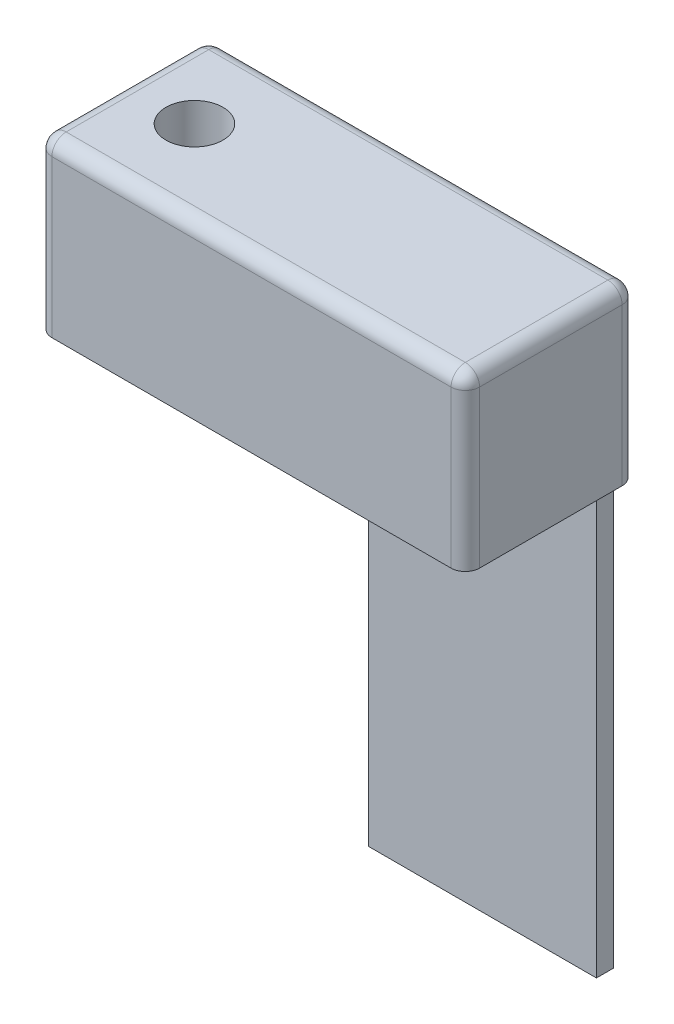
ISO-10303-21;
HEADER;
FILE_DESCRIPTION(('STEP AP214'),'2;1');
FILE_NAME('part.step','',(''),(''),'','','');
FILE_SCHEMA(('AUTOMOTIVE_DESIGN { 1 0 10303 214 1 1 1 1 }'));
ENDSEC;
DATA;
#1=APPLICATION_CONTEXT('core data for automotive mechanical design processes');
#2=APPLICATION_PROTOCOL_DEFINITION('international standard','automotive_design',2000,#1);
#3=PRODUCT_CONTEXT('',#1,'mechanical');
#4=PRODUCT('Part','Part','',(#3));
#5=PRODUCT_RELATED_PRODUCT_CATEGORY('part','',(#4));
#6=PRODUCT_DEFINITION_FORMATION('','',#4);
#7=PRODUCT_DEFINITION_CONTEXT('part definition',#1,'design');
#8=PRODUCT_DEFINITION('design','',#6,#7);
#9=PRODUCT_DEFINITION_SHAPE('','',#8);
#10=(LENGTH_UNIT() NAMED_UNIT(*) SI_UNIT(.MILLI.,.METRE.));
#11=(NAMED_UNIT(*) PLANE_ANGLE_UNIT() SI_UNIT($,.RADIAN.));
#12=(NAMED_UNIT(*) SI_UNIT($,.STERADIAN.) SOLID_ANGLE_UNIT());
#13=UNCERTAINTY_MEASURE_WITH_UNIT(LENGTH_MEASURE(1.E-05),#10,'distance_accuracy_value','');
#14=(GEOMETRIC_REPRESENTATION_CONTEXT(3) GLOBAL_UNCERTAINTY_ASSIGNED_CONTEXT((#13)) GLOBAL_UNIT_ASSIGNED_CONTEXT((#10,
#11,#12)) REPRESENTATION_CONTEXT('',''));
#15=CARTESIAN_POINT('',(0.,0.,0.));
#16=DIRECTION('',(0.,0.,1.));
#17=DIRECTION('',(1.,0.,0.));
#18=AXIS2_PLACEMENT_3D('',#15,#16,#17);
#19=CARTESIAN_POINT('',(0.,0.,0.));
#20=DIRECTION('',(0.,-1.,0.));
#21=DIRECTION('',(0.,0.,-1.));
#22=AXIS2_PLACEMENT_3D('',#19,#20,#21);
#23=PLANE('',#22);
#24=CARTESIAN_POINT('',(-127.,0.,0.));
#25=DIRECTION('',(0.,-1.,0.));
#26=DIRECTION('',(0.,0.,-1.));
#27=AXIS2_PLACEMENT_3D('',#24,#25,#26);
#28=CIRCLE('',#27,25.4);
#29=CARTESIAN_POINT('',(-127.,0.,25.4));
#30=VERTEX_POINT('',#29);
#31=EDGE_CURVE('E163',#30,#30,#28,.T.);
#32=ORIENTED_EDGE('',*,*,#31,.F.);
#33=EDGE_LOOP('',(#32));
#34=FACE_BOUND('',#33,.T.);
#35=DIRECTION('',(1.,0.,0.));
#36=VECTOR('',#35,1.);
#37=CARTESIAN_POINT('',(-190.5,0.,76.2));
#38=LINE('',#37,#36);
#39=CARTESIAN_POINT('',(-177.8,0.,76.2));
#40=VERTEX_POINT('',#39);
#41=CARTESIAN_POINT('',(177.8,0.,76.2));
#42=VERTEX_POINT('',#41);
#43=EDGE_CURVE('E183',#40,#42,#38,.T.);
#44=ORIENTED_EDGE('',*,*,#43,.F.);
#45=CARTESIAN_POINT('',(-177.8,0.,63.5));
#46=DIRECTION('',(0.,-1.,0.));
#47=DIRECTION('',(0.,0.,-1.));
#48=AXIS2_PLACEMENT_3D('',#45,#46,#47);
#49=CIRCLE('',#48,12.7);
#50=CARTESIAN_POINT('',(-190.5,0.,63.5));
#51=VERTEX_POINT('',#50);
#52=EDGE_CURVE('E201',#40,#51,#49,.T.);
#53=ORIENTED_EDGE('',*,*,#52,.T.);
#54=DIRECTION('',(0.,0.,1.));
#55=VECTOR('',#54,1.);
#56=CARTESIAN_POINT('',(-190.5,0.,76.2));
#57=LINE('',#56,#55);
#58=CARTESIAN_POINT('',(-190.5,0.,-63.4999999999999));
#59=VERTEX_POINT('',#58);
#60=EDGE_CURVE('E180',#59,#51,#57,.T.);
#61=ORIENTED_EDGE('',*,*,#60,.F.);
#62=CARTESIAN_POINT('',(-177.8,0.,-63.5));
#63=DIRECTION('',(0.,-1.,0.));
#64=DIRECTION('',(0.,0.,-1.));
#65=AXIS2_PLACEMENT_3D('',#62,#63,#64);
#66=CIRCLE('',#65,12.7);
#67=CARTESIAN_POINT('',(-177.8,0.,-76.2));
#68=VERTEX_POINT('',#67);
#69=EDGE_CURVE('E199',#59,#68,#66,.T.);
#70=ORIENTED_EDGE('',*,*,#69,.T.);
#71=DIRECTION('',(-1.,0.,0.));
#72=VECTOR('',#71,1.);
#73=CARTESIAN_POINT('',(-190.5,0.,-76.2));
#74=LINE('',#73,#72);
#75=CARTESIAN_POINT('',(177.8,0.,-76.2));
#76=VERTEX_POINT('',#75);
#77=EDGE_CURVE('E177',#76,#68,#74,.T.);
#78=ORIENTED_EDGE('',*,*,#77,.F.);
#79=CARTESIAN_POINT('',(177.8,0.,-63.5));
#80=DIRECTION('',(0.,-1.,0.));
#81=DIRECTION('',(0.,0.,-1.));
#82=AXIS2_PLACEMENT_3D('',#79,#80,#81);
#83=CIRCLE('',#82,12.7);
#84=CARTESIAN_POINT('',(190.5,0.,-63.4999999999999));
#85=VERTEX_POINT('',#84);
#86=EDGE_CURVE('E197',#76,#85,#83,.T.);
#87=ORIENTED_EDGE('',*,*,#86,.T.);
#88=DIRECTION('',(0.,0.,-1.));
#89=VECTOR('',#88,1.);
#90=CARTESIAN_POINT('',(190.5,0.,76.2));
#91=LINE('',#90,#89);
#92=CARTESIAN_POINT('',(190.5,0.,63.5));
#93=VERTEX_POINT('',#92);
#94=EDGE_CURVE('E172',#93,#85,#91,.T.);
#95=ORIENTED_EDGE('',*,*,#94,.F.);
#96=CARTESIAN_POINT('',(177.8,0.,63.5));
#97=DIRECTION('',(0.,-1.,0.));
#98=DIRECTION('',(0.,0.,-1.));
#99=AXIS2_PLACEMENT_3D('',#96,#97,#98);
#100=CIRCLE('',#99,12.7);
#101=EDGE_CURVE('E195',#93,#42,#100,.T.);
#102=ORIENTED_EDGE('',*,*,#101,.T.);
#103=EDGE_LOOP('',(#44,#53,#61,#70,#78,#87,#95,#102));
#104=FACE_BOUND('',#103,.T.);
#105=DIRECTION('',(-1.,0.,0.));
#106=VECTOR('',#105,1.);
#107=CARTESIAN_POINT('',(-25.4,0.,-53.34));
#108=LINE('',#107,#106);
#109=CARTESIAN_POINT('',(177.8,0.,-53.34));
#110=VERTEX_POINT('',#109);
#111=CARTESIAN_POINT('',(-25.4,0.,-53.34));
#112=VERTEX_POINT('',#111);
#113=EDGE_CURVE('E264',#110,#112,#108,.T.);
#114=ORIENTED_EDGE('',*,*,#113,.F.);
#115=DIRECTION('',(0.,0.,1.));
#116=VECTOR('',#115,1.);
#117=CARTESIAN_POINT('',(177.8,0.,-53.34));
#118=LINE('',#117,#116);
#119=CARTESIAN_POINT('',(177.8,0.,-68.58));
#120=VERTEX_POINT('',#119);
#121=EDGE_CURVE('E158',#120,#110,#118,.T.);
#122=ORIENTED_EDGE('',*,*,#121,.F.);
#123=DIRECTION('',(1.,0.,0.));
#124=VECTOR('',#123,1.);
#125=CARTESIAN_POINT('',(-25.3999999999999,0.,-68.58));
#126=LINE('',#125,#124);
#127=CARTESIAN_POINT('',(-25.3999999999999,0.,-68.58));
#128=VERTEX_POINT('',#127);
#129=EDGE_CURVE('E154',#128,#120,#126,.T.);
#130=ORIENTED_EDGE('',*,*,#129,.F.);
#131=DIRECTION('',(0.,0.,-1.));
#132=VECTOR('',#131,1.);
#133=CARTESIAN_POINT('',(-25.4,0.,-53.34));
#134=LINE('',#133,#132);
#135=EDGE_CURVE('E266',#112,#128,#134,.T.);
#136=ORIENTED_EDGE('',*,*,#135,.F.);
#137=EDGE_LOOP('',(#114,#122,#130,#136));
#138=FACE_BOUND('',#137,.T.);
#139=ADVANCED_FACE('F35',(#34,#104,#138),#23,.T.);
#140=CARTESIAN_POINT('',(190.5,152.4,76.2));
#141=DIRECTION('',(-1.,0.,0.));
#142=DIRECTION('',(0.,0.,1.));
#143=AXIS2_PLACEMENT_3D('',#140,#141,#142);
#144=PLANE('',#143);
#145=ORIENTED_EDGE('',*,*,#94,.T.);
#146=DIRECTION('',(0.,-1.,0.));
#147=VECTOR('',#146,1.);
#148=CARTESIAN_POINT('',(190.5,152.4,-63.5));
#149=LINE('',#148,#147);
#150=CARTESIAN_POINT('',(190.5,139.7,-63.5));
#151=VERTEX_POINT('',#150);
#152=EDGE_CURVE('E11',#85,#151,#149,.F.);
#153=ORIENTED_EDGE('',*,*,#152,.T.);
#154=DIRECTION('',(0.,0.,-1.));
#155=VECTOR('',#154,1.);
#156=CARTESIAN_POINT('',(190.5,139.7,76.2));
#157=LINE('',#156,#155);
#158=CARTESIAN_POINT('',(190.5,139.7,63.5));
#159=VERTEX_POINT('',#158);
#160=EDGE_CURVE('E44',#151,#159,#157,.F.);
#161=ORIENTED_EDGE('',*,*,#160,.T.);
#162=DIRECTION('',(0.,-1.,0.));
#163=VECTOR('',#162,1.);
#164=CARTESIAN_POINT('',(190.5,152.4,63.5));
#165=LINE('',#164,#163);
#166=EDGE_CURVE('E224',#159,#93,#165,.T.);
#167=ORIENTED_EDGE('',*,*,#166,.T.);
#168=EDGE_LOOP('',(#145,#153,#161,#167));
#169=FACE_BOUND('',#168,.T.);
#170=ADVANCED_FACE('F284',(#169),#144,.F.);
#171=CARTESIAN_POINT('',(-190.5,152.4,-76.2));
#172=DIRECTION('',(0.,0.,1.));
#173=DIRECTION('',(1.,0.,0.));
#174=AXIS2_PLACEMENT_3D('',#171,#172,#173);
#175=PLANE('',#174);
#176=CARTESIAN_POINT('',(0.,76.2,-76.2));
#177=DIRECTION('',(0.,0.,-1.));
#178=DIRECTION('',(-1.,0.,0.));
#179=AXIS2_PLACEMENT_3D('',#176,#177,#178);
#180=CIRCLE('',#179,50.8);
#181=CARTESIAN_POINT('',(-50.8,76.2,-76.2));
#182=VERTEX_POINT('',#181);
#183=EDGE_CURVE('E173',#182,#182,#180,.T.);
#184=ORIENTED_EDGE('',*,*,#183,.F.);
#185=EDGE_LOOP('',(#184));
#186=FACE_BOUND('',#185,.T.);
#187=ORIENTED_EDGE('',*,*,#77,.T.);
#188=DIRECTION('',(0.,-1.,0.));
#189=VECTOR('',#188,1.);
#190=CARTESIAN_POINT('',(-177.8,152.4,-76.2));
#191=LINE('',#190,#189);
#192=CARTESIAN_POINT('',(-177.8,139.7,-76.2));
#193=VERTEX_POINT('',#192);
#194=EDGE_CURVE('E222',#68,#193,#191,.F.);
#195=ORIENTED_EDGE('',*,*,#194,.T.);
#196=DIRECTION('',(-1.,0.,0.));
#197=VECTOR('',#196,1.);
#198=CARTESIAN_POINT('',(-190.5,139.7,-76.2));
#199=LINE('',#198,#197);
#200=CARTESIAN_POINT('',(177.8,139.7,-76.2));
#201=VERTEX_POINT('',#200);
#202=EDGE_CURVE('E220',#193,#201,#199,.F.);
#203=ORIENTED_EDGE('',*,*,#202,.T.);
#204=DIRECTION('',(0.,-1.,0.));
#205=VECTOR('',#204,1.);
#206=CARTESIAN_POINT('',(177.8,152.4,-76.2));
#207=LINE('',#206,#205);
#208=EDGE_CURVE('E218',#201,#76,#207,.T.);
#209=ORIENTED_EDGE('',*,*,#208,.T.);
#210=EDGE_LOOP('',(#187,#195,#203,#209));
#211=FACE_BOUND('',#210,.T.);
#212=ADVANCED_FACE('F290',(#186,#211),#175,.F.);
#213=CARTESIAN_POINT('',(-190.5,152.4,76.2));
#214=DIRECTION('',(1.,0.,0.));
#215=DIRECTION('',(0.,0.,-1.));
#216=AXIS2_PLACEMENT_3D('',#213,#214,#215);
#217=PLANE('',#216);
#218=ORIENTED_EDGE('',*,*,#60,.T.);
#219=DIRECTION('',(0.,-1.,0.));
#220=VECTOR('',#219,1.);
#221=CARTESIAN_POINT('',(-190.5,152.4,63.5));
#222=LINE('',#221,#220);
#223=CARTESIAN_POINT('',(-190.5,139.7,63.5));
#224=VERTEX_POINT('',#223);
#225=EDGE_CURVE('E207',#51,#224,#222,.F.);
#226=ORIENTED_EDGE('',*,*,#225,.T.);
#227=DIRECTION('',(0.,0.,1.));
#228=VECTOR('',#227,1.);
#229=CARTESIAN_POINT('',(-190.5,139.7,76.2));
#230=LINE('',#229,#228);
#231=CARTESIAN_POINT('',(-190.5,139.7,-63.5));
#232=VERTEX_POINT('',#231);
#233=EDGE_CURVE('E205',#224,#232,#230,.F.);
#234=ORIENTED_EDGE('',*,*,#233,.T.);
#235=DIRECTION('',(0.,-1.,0.));
#236=VECTOR('',#235,1.);
#237=CARTESIAN_POINT('',(-190.5,152.4,-63.5));
#238=LINE('',#237,#236);
#239=EDGE_CURVE('E203',#232,#59,#238,.T.);
#240=ORIENTED_EDGE('',*,*,#239,.T.);
#241=EDGE_LOOP('',(#218,#226,#234,#240));
#242=FACE_BOUND('',#241,.T.);
#243=ADVANCED_FACE('F301',(#242),#217,.F.);
#244=CARTESIAN_POINT('',(-190.5,152.4,76.2));
#245=DIRECTION('',(0.,0.,-1.));
#246=DIRECTION('',(-1.,0.,0.));
#247=AXIS2_PLACEMENT_3D('',#244,#245,#246);
#248=PLANE('',#247);
#249=DIRECTION('',(1.,0.,0.));
#250=VECTOR('',#249,1.);
#251=CARTESIAN_POINT('',(-190.5,139.7,76.2));
#252=LINE('',#251,#250);
#253=CARTESIAN_POINT('',(177.8,139.7,76.2));
#254=VERTEX_POINT('',#253);
#255=CARTESIAN_POINT('',(-177.8,139.7,76.2));
#256=VERTEX_POINT('',#255);
#257=EDGE_CURVE('E190',#254,#256,#252,.F.);
#258=ORIENTED_EDGE('',*,*,#257,.T.);
#259=DIRECTION('',(0.,-1.,0.));
#260=VECTOR('',#259,1.);
#261=CARTESIAN_POINT('',(-177.8,152.4,76.2));
#262=LINE('',#261,#260);
#263=EDGE_CURVE('E192',#256,#40,#262,.T.);
#264=ORIENTED_EDGE('',*,*,#263,.T.);
#265=ORIENTED_EDGE('',*,*,#43,.T.);
#266=DIRECTION('',(0.,-1.,0.));
#267=VECTOR('',#266,1.);
#268=CARTESIAN_POINT('',(177.8,152.4,76.2));
#269=LINE('',#268,#267);
#270=EDGE_CURVE('E186',#42,#254,#269,.F.);
#271=ORIENTED_EDGE('',*,*,#270,.T.);
#272=EDGE_LOOP('',(#258,#264,#265,#271));
#273=FACE_BOUND('',#272,.T.);
#274=ADVANCED_FACE('F298',(#273),#248,.F.);
#275=CARTESIAN_POINT('',(0.,152.4,0.));
#276=DIRECTION('',(0.,-1.,0.));
#277=DIRECTION('',(0.,0.,-1.));
#278=AXIS2_PLACEMENT_3D('',#275,#276,#277);
#279=PLANE('',#278);
#280=DIRECTION('',(0.,0.,1.));
#281=VECTOR('',#280,1.);
#282=CARTESIAN_POINT('',(-177.8,152.4,0.));
#283=LINE('',#282,#281);
#284=CARTESIAN_POINT('',(-177.8,152.4,-63.5));
#285=VERTEX_POINT('',#284);
#286=CARTESIAN_POINT('',(-177.8,152.4,63.5));
#287=VERTEX_POINT('',#286);
#288=EDGE_CURVE('E213',#285,#287,#283,.T.);
#289=ORIENTED_EDGE('',*,*,#288,.T.);
#290=DIRECTION('',(1.,0.,0.));
#291=VECTOR('',#290,1.);
#292=CARTESIAN_POINT('',(0.,152.4,63.5));
#293=LINE('',#292,#291);
#294=CARTESIAN_POINT('',(177.8,152.4,63.5));
#295=VERTEX_POINT('',#294);
#296=EDGE_CURVE('E215',#287,#295,#293,.T.);
#297=ORIENTED_EDGE('',*,*,#296,.T.);
#298=DIRECTION('',(0.,0.,-1.));
#299=VECTOR('',#298,1.);
#300=CARTESIAN_POINT('',(177.8,152.4,0.));
#301=LINE('',#300,#299);
#302=CARTESIAN_POINT('',(177.8,152.4,-63.5));
#303=VERTEX_POINT('',#302);
#304=EDGE_CURVE('E209',#295,#303,#301,.T.);
#305=ORIENTED_EDGE('',*,*,#304,.T.);
#306=DIRECTION('',(-1.,0.,0.));
#307=VECTOR('',#306,1.);
#308=CARTESIAN_POINT('',(0.,152.4,-63.5));
#309=LINE('',#308,#307);
#310=EDGE_CURVE('E211',#303,#285,#309,.T.);
#311=ORIENTED_EDGE('',*,*,#310,.T.);
#312=EDGE_LOOP('',(#289,#297,#305,#311));
#313=FACE_BOUND('',#312,.T.);
#314=CARTESIAN_POINT('',(-127.,152.4,0.));
#315=DIRECTION('',(0.,1.,0.));
#316=DIRECTION('',(0.,0.,1.));
#317=AXIS2_PLACEMENT_3D('',#314,#315,#316);
#318=CIRCLE('',#317,25.4);
#319=CARTESIAN_POINT('',(-127.,152.4,25.4));
#320=VERTEX_POINT('',#319);
#321=EDGE_CURVE('E160',#320,#320,#318,.T.);
#322=ORIENTED_EDGE('',*,*,#321,.F.);
#323=EDGE_LOOP('',(#322));
#324=FACE_BOUND('',#323,.T.);
#325=ADVANCED_FACE('F296',(#313,#324),#279,.F.);
#326=CARTESIAN_POINT('',(0.,76.2,0.));
#327=DIRECTION('',(0.,0.,-1.));
#328=DIRECTION('',(-1.,0.,0.));
#329=AXIS2_PLACEMENT_3D('',#326,#327,#328);
#330=CYLINDRICAL_SURFACE('',#329,50.8);
#331=CARTESIAN_POINT('',(0.,76.2,0.));
#332=DIRECTION('',(0.,0.,-1.));
#333=DIRECTION('',(-1.,0.,0.));
#334=AXIS2_PLACEMENT_3D('',#331,#332,#333);
#335=CIRCLE('',#334,50.8);
#336=CARTESIAN_POINT('',(-50.8,76.2,0.));
#337=VERTEX_POINT('',#336);
#338=EDGE_CURVE('E169',#337,#337,#335,.T.);
#339=CARTESIAN_POINT('',(-50.8,76.2,0.));
#340=CARTESIAN_POINT('',(-50.8,76.2,-0.79375));
#341=CARTESIAN_POINT('',(-50.8,76.2,-1.5875));
#342=CARTESIAN_POINT('',(-50.8,76.2,-3.175));
#343=CARTESIAN_POINT('',(-50.8,76.2,-3.96875));
#344=CARTESIAN_POINT('',(-50.8,76.2,-5.55625));
#345=CARTESIAN_POINT('',(-50.8,76.2,-6.35));
#346=CARTESIAN_POINT('',(-50.8,76.2,-7.9375));
#347=CARTESIAN_POINT('',(-50.8,76.2,-8.73125));
#348=CARTESIAN_POINT('',(-50.8,76.2,-10.31875));
#349=CARTESIAN_POINT('',(-50.8,76.2,-11.1125));
#350=CARTESIAN_POINT('',(-50.8,76.2,-12.7));
#351=CARTESIAN_POINT('',(-50.8,76.2,-13.49375));
#352=CARTESIAN_POINT('',(-50.8,76.2,-15.08125));
#353=CARTESIAN_POINT('',(-50.8,76.2,-15.875));
#354=CARTESIAN_POINT('',(-50.8,76.2,-17.4625));
#355=CARTESIAN_POINT('',(-50.8,76.2,-18.25625));
#356=CARTESIAN_POINT('',(-50.8,76.2,-19.84375));
#357=CARTESIAN_POINT('',(-50.8,76.2,-20.6375));
#358=CARTESIAN_POINT('',(-50.8,76.2,-22.225));
#359=CARTESIAN_POINT('',(-50.8,76.2,-23.01875));
#360=CARTESIAN_POINT('',(-50.8,76.2,-24.60625));
#361=CARTESIAN_POINT('',(-50.8,76.2,-25.4));
#362=CARTESIAN_POINT('',(-50.8,76.2,-26.9875));
#363=CARTESIAN_POINT('',(-50.8,76.2,-27.78125));
#364=CARTESIAN_POINT('',(-50.8,76.2,-29.36875));
#365=CARTESIAN_POINT('',(-50.8,76.2,-30.1625));
#366=CARTESIAN_POINT('',(-50.8,76.2,-31.75));
#367=CARTESIAN_POINT('',(-50.8,76.2,-32.54375));
#368=CARTESIAN_POINT('',(-50.8,76.2,-34.13125));
#369=CARTESIAN_POINT('',(-50.8,76.2,-34.925));
#370=CARTESIAN_POINT('',(-50.8,76.2,-36.5125));
#371=CARTESIAN_POINT('',(-50.8,76.2,-37.30625));
#372=CARTESIAN_POINT('',(-50.8,76.2,-38.89375));
#373=CARTESIAN_POINT('',(-50.8,76.2,-39.6875));
#374=CARTESIAN_POINT('',(-50.8,76.2,-41.275));
#375=CARTESIAN_POINT('',(-50.8,76.2,-42.06875));
#376=CARTESIAN_POINT('',(-50.8,76.2,-43.65625));
#377=CARTESIAN_POINT('',(-50.8,76.2,-44.45));
#378=CARTESIAN_POINT('',(-50.8,76.2,-46.0375));
#379=CARTESIAN_POINT('',(-50.8,76.2,-46.83125));
#380=CARTESIAN_POINT('',(-50.8,76.2,-48.41875));
#381=CARTESIAN_POINT('',(-50.8,76.2,-49.2125));
#382=CARTESIAN_POINT('',(-50.8,76.2,-50.8));
#383=CARTESIAN_POINT('',(-50.8,76.2,-51.59375));
#384=CARTESIAN_POINT('',(-50.8,76.2,-53.18125));
#385=CARTESIAN_POINT('',(-50.8,76.2,-53.975));
#386=CARTESIAN_POINT('',(-50.8,76.2,-55.5625));
#387=CARTESIAN_POINT('',(-50.8,76.2,-56.35625));
#388=CARTESIAN_POINT('',(-50.8,76.2,-57.94375));
#389=CARTESIAN_POINT('',(-50.8,76.2,-58.7375));
#390=CARTESIAN_POINT('',(-50.8,76.2,-60.325));
#391=CARTESIAN_POINT('',(-50.8,76.2,-61.11875));
#392=CARTESIAN_POINT('',(-50.8,76.2,-62.70625));
#393=CARTESIAN_POINT('',(-50.8,76.2,-63.5));
#394=CARTESIAN_POINT('',(-50.8,76.2,-65.0875));
#395=CARTESIAN_POINT('',(-50.8,76.2,-65.88125));
#396=CARTESIAN_POINT('',(-50.8,76.2,-67.46875));
#397=CARTESIAN_POINT('',(-50.8,76.2,-68.2625));
#398=CARTESIAN_POINT('',(-50.8,76.2,-69.85));
#399=CARTESIAN_POINT('',(-50.8,76.2,-70.64375));
#400=CARTESIAN_POINT('',(-50.8,76.2,-72.23125));
#401=CARTESIAN_POINT('',(-50.8,76.2,-73.025));
#402=CARTESIAN_POINT('',(-50.8,76.2,-74.6125));
#403=CARTESIAN_POINT('',(-50.8,76.2,-75.40625));
#404=CARTESIAN_POINT('',(-50.8,76.2,-76.2));
#405=B_SPLINE_CURVE_WITH_KNOTS('',3,(#339,#340,#341,#342,#343,#344,#345,#346,#347,#348,#349,
#350,#351,#352,#353,#354,#355,#356,#357,#358,#359,#360,#361,#362,#363,#364,#365,#366,#367,#368,
#369,#370,#371,#372,#373,#374,#375,#376,#377,#378,#379,#380,#381,#382,#383,#384,#385,#386,#387,
#388,#389,#390,#391,#392,#393,#394,#395,#396,#397,#398,#399,#400,#401,#402,#403,#404),
.UNSPECIFIED.,.F.,.F.,(4,2,2,2,2,2,2,2,2,2,2,2,2,2,2,2,2,2,2,2,2,2,2,2,2,2,2,2,2,2,2,2,4),(0.,
2.38125,4.7625,7.14375,9.525,11.90625,14.2875,16.66875,19.05,21.43125,23.8125,26.19375,28.575,
30.95625,33.3375,35.71875,38.1,40.48125,42.8625,45.24375,47.625,50.00625,52.3875,54.76875,57.15,
59.53125,61.9125,64.29375,66.675,69.05625,71.4375,73.81875,76.2),.UNSPECIFIED.);
#406=EDGE_CURVE('BSEAM384',#337,#182,#405,.T.);
#407=ORIENTED_EDGE('',*,*,#338,.F.);
#408=ORIENTED_EDGE('',*,*,#183,.T.);
#409=ORIENTED_EDGE('',*,*,#406,.T.);
#410=ORIENTED_EDGE('',*,*,#406,.F.);
#411=EDGE_LOOP('',(#407,#409,#408,#410));
#412=FACE_BOUND('',#411,.T.);
#413=ADVANCED_FACE('F384',(#412),#330,.F.);
#414=CARTESIAN_POINT('',(0.,76.2,0.));
#415=DIRECTION('',(0.,0.,-1.));
#416=DIRECTION('',(-1.,0.,0.));
#417=AXIS2_PLACEMENT_3D('',#414,#415,#416);
#418=PLANE('',#417);
#419=ORIENTED_EDGE('',*,*,#338,.T.);
#420=EDGE_LOOP('',(#419));
#421=FACE_BOUND('',#420,.T.);
#422=ADVANCED_FACE('F389',(#421),#418,.T.);
#423=CARTESIAN_POINT('',(-127.,-50.7999999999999,0.));
#424=DIRECTION('',(0.,1.,0.));
#425=DIRECTION('',(0.,0.,1.));
#426=AXIS2_PLACEMENT_3D('',#423,#424,#425);
#427=CYLINDRICAL_SURFACE('',#426,25.4);
#428=CARTESIAN_POINT('',(-127.,0.,25.4));
#429=CARTESIAN_POINT('',(-127.,1.58750000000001,25.4));
#430=CARTESIAN_POINT('',(-127.,3.17500000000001,25.4));
#431=CARTESIAN_POINT('',(-127.,6.35000000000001,25.4));
#432=CARTESIAN_POINT('',(-127.,7.93750000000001,25.4));
#433=CARTESIAN_POINT('',(-127.,11.1125,25.4));
#434=CARTESIAN_POINT('',(-127.,12.7,25.4));
#435=CARTESIAN_POINT('',(-127.,15.875,25.4));
#436=CARTESIAN_POINT('',(-127.,17.4625,25.4));
#437=CARTESIAN_POINT('',(-127.,20.6375,25.4));
#438=CARTESIAN_POINT('',(-127.,22.225,25.4));
#439=CARTESIAN_POINT('',(-127.,25.4,25.4));
#440=CARTESIAN_POINT('',(-127.,26.9875,25.4));
#441=CARTESIAN_POINT('',(-127.,30.1625,25.4));
#442=CARTESIAN_POINT('',(-127.,31.75,25.4));
#443=CARTESIAN_POINT('',(-127.,34.925,25.4));
#444=CARTESIAN_POINT('',(-127.,36.5125,25.4));
#445=CARTESIAN_POINT('',(-127.,39.6875,25.4));
#446=CARTESIAN_POINT('',(-127.,41.275,25.4));
#447=CARTESIAN_POINT('',(-127.,44.45,25.4));
#448=CARTESIAN_POINT('',(-127.,46.0375,25.4));
#449=CARTESIAN_POINT('',(-127.,49.2125,25.4));
#450=CARTESIAN_POINT('',(-127.,50.8,25.4));
#451=CARTESIAN_POINT('',(-127.,53.975,25.4));
#452=CARTESIAN_POINT('',(-127.,55.5625,25.4));
#453=CARTESIAN_POINT('',(-127.,58.7375,25.4));
#454=CARTESIAN_POINT('',(-127.,60.325,25.4));
#455=CARTESIAN_POINT('',(-127.,63.5,25.4));
#456=CARTESIAN_POINT('',(-127.,65.0875,25.4));
#457=CARTESIAN_POINT('',(-127.,68.2625,25.4));
#458=CARTESIAN_POINT('',(-127.,69.85,25.4));
#459=CARTESIAN_POINT('',(-127.,73.025,25.4));
#460=CARTESIAN_POINT('',(-127.,74.6125,25.4));
#461=CARTESIAN_POINT('',(-127.,77.7875,25.4));
#462=CARTESIAN_POINT('',(-127.,79.375,25.4));
#463=CARTESIAN_POINT('',(-127.,82.55,25.4));
#464=CARTESIAN_POINT('',(-127.,84.1375,25.4));
#465=CARTESIAN_POINT('',(-127.,87.3125,25.4));
#466=CARTESIAN_POINT('',(-127.,88.9,25.4));
#467=CARTESIAN_POINT('',(-127.,92.075,25.4));
#468=CARTESIAN_POINT('',(-127.,93.6625,25.4));
#469=CARTESIAN_POINT('',(-127.,96.8375,25.4));
#470=CARTESIAN_POINT('',(-127.,98.425,25.4));
#471=CARTESIAN_POINT('',(-127.,101.6,25.4));
#472=CARTESIAN_POINT('',(-127.,103.1875,25.4));
#473=CARTESIAN_POINT('',(-127.,106.3625,25.4));
#474=CARTESIAN_POINT('',(-127.,107.95,25.4));
#475=CARTESIAN_POINT('',(-127.,111.125,25.4));
#476=CARTESIAN_POINT('',(-127.,112.7125,25.4));
#477=CARTESIAN_POINT('',(-127.,115.8875,25.4));
#478=CARTESIAN_POINT('',(-127.,117.475,25.4));
#479=CARTESIAN_POINT('',(-127.,120.65,25.4));
#480=CARTESIAN_POINT('',(-127.,122.2375,25.4));
#481=CARTESIAN_POINT('',(-127.,125.4125,25.4));
#482=CARTESIAN_POINT('',(-127.,127.,25.4));
#483=CARTESIAN_POINT('',(-127.,130.175,25.4));
#484=CARTESIAN_POINT('',(-127.,131.7625,25.4));
#485=CARTESIAN_POINT('',(-127.,134.9375,25.4));
#486=CARTESIAN_POINT('',(-127.,136.525,25.4));
#487=CARTESIAN_POINT('',(-127.,139.7,25.4));
#488=CARTESIAN_POINT('',(-127.,141.2875,25.4));
#489=CARTESIAN_POINT('',(-127.,144.4625,25.4));
#490=CARTESIAN_POINT('',(-127.,146.05,25.4));
#491=CARTESIAN_POINT('',(-127.,149.225,25.4));
#492=CARTESIAN_POINT('',(-127.,150.8125,25.4));
#493=CARTESIAN_POINT('',(-127.,152.4,25.4));
#494=B_SPLINE_CURVE_WITH_KNOTS('',3,(#428,#429,#430,#431,#432,#433,#434,#435,#436,#437,#438,
#439,#440,#441,#442,#443,#444,#445,#446,#447,#448,#449,#450,#451,#452,#453,#454,#455,#456,#457,
#458,#459,#460,#461,#462,#463,#464,#465,#466,#467,#468,#469,#470,#471,#472,#473,#474,#475,#476,
#477,#478,#479,#480,#481,#482,#483,#484,#485,#486,#487,#488,#489,#490,#491,#492,#493),
.UNSPECIFIED.,.F.,.F.,(4,2,2,2,2,2,2,2,2,2,2,2,2,2,2,2,2,2,2,2,2,2,2,2,2,2,2,2,2,2,2,2,4),(0.,
4.7625,9.52500000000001,14.2875,19.05,23.8125,28.575,33.3375,38.1,42.8625,47.625,52.3875,57.15,
61.9125,66.675,71.4375,76.2,80.9625,85.725,90.4875,95.25,100.0125,104.775,109.5375,114.3,
119.0625,123.825,128.5875,133.35,138.1125,142.875,147.6375,152.4),.UNSPECIFIED.);
#495=EDGE_CURVE('BSEAM387',#30,#320,#494,.T.);
#496=ORIENTED_EDGE('',*,*,#31,.T.);
#497=ORIENTED_EDGE('',*,*,#321,.T.);
#498=ORIENTED_EDGE('',*,*,#495,.T.);
#499=ORIENTED_EDGE('',*,*,#495,.F.);
#500=EDGE_LOOP('',(#496,#498,#497,#499));
#501=FACE_BOUND('',#500,.T.);
#502=ADVANCED_FACE('F387',(#501),#427,.F.);
#503=CARTESIAN_POINT('',(177.8,-381.,-53.34));
#504=DIRECTION('',(-1.,0.,0.));
#505=DIRECTION('',(0.,0.,1.));
#506=AXIS2_PLACEMENT_3D('',#503,#504,#505);
#507=PLANE('',#506);
#508=ORIENTED_EDGE('',*,*,#121,.T.);
#509=DIRECTION('',(0.,1.,0.));
#510=VECTOR('',#509,1.);
#511=CARTESIAN_POINT('',(177.8,-381.,-53.34));
#512=LINE('',#511,#510);
#513=CARTESIAN_POINT('',(177.8,-381.,-53.34));
#514=VERTEX_POINT('',#513);
#515=EDGE_CURVE('E138',#514,#110,#512,.T.);
#516=ORIENTED_EDGE('',*,*,#515,.F.);
#517=DIRECTION('',(0.,0.,1.));
#518=VECTOR('',#517,1.);
#519=CARTESIAN_POINT('',(177.8,-381.,-53.34));
#520=LINE('',#519,#518);
#521=CARTESIAN_POINT('',(177.8,-381.,-68.58));
#522=VERTEX_POINT('',#521);
#523=EDGE_CURVE('E145',#522,#514,#520,.T.);
#524=ORIENTED_EDGE('',*,*,#523,.F.);
#525=DIRECTION('',(0.,1.,0.));
#526=VECTOR('',#525,1.);
#527=CARTESIAN_POINT('',(177.8,-381.,-68.58));
#528=LINE('',#527,#526);
#529=EDGE_CURVE('E274',#522,#120,#528,.T.);
#530=ORIENTED_EDGE('',*,*,#529,.T.);
#531=EDGE_LOOP('',(#508,#516,#524,#530));
#532=FACE_BOUND('',#531,.T.);
#533=ADVANCED_FACE('F156',(#532),#507,.F.);
#534=CARTESIAN_POINT('',(-25.4,-381.,-53.34));
#535=DIRECTION('',(0.,0.,-1.));
#536=DIRECTION('',(-1.,0.,0.));
#537=AXIS2_PLACEMENT_3D('',#534,#535,#536);
#538=PLANE('',#537);
#539=ORIENTED_EDGE('',*,*,#113,.T.);
#540=DIRECTION('',(0.,1.,0.));
#541=VECTOR('',#540,1.);
#542=CARTESIAN_POINT('',(-25.4,-381.,-53.34));
#543=LINE('',#542,#541);
#544=CARTESIAN_POINT('',(-25.4,-381.,-53.34));
#545=VERTEX_POINT('',#544);
#546=EDGE_CURVE('E141',#545,#112,#543,.T.);
#547=ORIENTED_EDGE('',*,*,#546,.F.);
#548=DIRECTION('',(-1.,0.,0.));
#549=VECTOR('',#548,1.);
#550=CARTESIAN_POINT('',(-25.4,-381.,-53.34));
#551=LINE('',#550,#549);
#552=EDGE_CURVE('E134',#514,#545,#551,.T.);
#553=ORIENTED_EDGE('',*,*,#552,.F.);
#554=ORIENTED_EDGE('',*,*,#515,.T.);
#555=EDGE_LOOP('',(#539,#547,#553,#554));
#556=FACE_BOUND('',#555,.T.);
#557=ADVANCED_FACE('F136',(#556),#538,.F.);
#558=CARTESIAN_POINT('',(-25.4,-381.,-53.34));
#559=DIRECTION('',(1.,0.,0.));
#560=DIRECTION('',(0.,0.,-1.));
#561=AXIS2_PLACEMENT_3D('',#558,#559,#560);
#562=PLANE('',#561);
#563=ORIENTED_EDGE('',*,*,#135,.T.);
#564=DIRECTION('',(0.,1.,0.));
#565=VECTOR('',#564,1.);
#566=CARTESIAN_POINT('',(-25.3999999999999,-381.,-68.58));
#567=LINE('',#566,#565);
#568=CARTESIAN_POINT('',(-25.3999999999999,-381.,-68.58));
#569=VERTEX_POINT('',#568);
#570=EDGE_CURVE('E165',#569,#128,#567,.T.);
#571=ORIENTED_EDGE('',*,*,#570,.F.);
#572=DIRECTION('',(0.,0.,-1.));
#573=VECTOR('',#572,1.);
#574=CARTESIAN_POINT('',(-25.4,-381.,-53.34));
#575=LINE('',#574,#573);
#576=EDGE_CURVE('E144',#545,#569,#575,.T.);
#577=ORIENTED_EDGE('',*,*,#576,.F.);
#578=ORIENTED_EDGE('',*,*,#546,.T.);
#579=EDGE_LOOP('',(#563,#571,#577,#578));
#580=FACE_BOUND('',#579,.T.);
#581=ADVANCED_FACE('F281',(#580),#562,.F.);
#582=CARTESIAN_POINT('',(-25.3999999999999,-381.,-68.58));
#583=DIRECTION('',(0.,0.,1.));
#584=DIRECTION('',(1.,0.,0.));
#585=AXIS2_PLACEMENT_3D('',#582,#583,#584);
#586=PLANE('',#585);
#587=ORIENTED_EDGE('',*,*,#129,.T.);
#588=ORIENTED_EDGE('',*,*,#529,.F.);
#589=DIRECTION('',(1.,0.,0.));
#590=VECTOR('',#589,1.);
#591=CARTESIAN_POINT('',(-25.3999999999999,-381.,-68.58));
#592=LINE('',#591,#590);
#593=EDGE_CURVE('E150',#569,#522,#592,.T.);
#594=ORIENTED_EDGE('',*,*,#593,.F.);
#595=ORIENTED_EDGE('',*,*,#570,.T.);
#596=EDGE_LOOP('',(#587,#588,#594,#595));
#597=FACE_BOUND('',#596,.T.);
#598=ADVANCED_FACE('F277',(#597),#586,.F.);
#599=CARTESIAN_POINT('',(0.,-381.,0.));
#600=DIRECTION('',(0.,-1.,0.));
#601=DIRECTION('',(0.,0.,-1.));
#602=AXIS2_PLACEMENT_3D('',#599,#600,#601);
#603=PLANE('',#602);
#604=ORIENTED_EDGE('',*,*,#523,.T.);
#605=ORIENTED_EDGE('',*,*,#552,.T.);
#606=ORIENTED_EDGE('',*,*,#576,.T.);
#607=ORIENTED_EDGE('',*,*,#593,.T.);
#608=EDGE_LOOP('',(#604,#605,#606,#607));
#609=FACE_BOUND('',#608,.T.);
#610=ADVANCED_FACE('F148',(#609),#603,.T.);
#611=CARTESIAN_POINT('',(177.8,152.4,-63.5));
#612=DIRECTION('',(0.,-1.,0.));
#613=DIRECTION('',(0.,0.,-1.));
#614=AXIS2_PLACEMENT_3D('',#611,#612,#613);
#615=CYLINDRICAL_SURFACE('',#614,12.7);
#616=CARTESIAN_POINT('',(177.8,139.7,-63.5));
#617=DIRECTION('',(0.,1.,0.));
#618=DIRECTION('',(0.,0.,1.));
#619=AXIS2_PLACEMENT_3D('',#616,#617,#618);
#620=CIRCLE('',#619,12.7);
#621=EDGE_CURVE('E39',#151,#201,#620,.T.);
#622=ORIENTED_EDGE('',*,*,#621,.F.);
#623=ORIENTED_EDGE('',*,*,#152,.F.);
#624=ORIENTED_EDGE('',*,*,#86,.F.);
#625=ORIENTED_EDGE('',*,*,#208,.F.);
#626=EDGE_LOOP('',(#622,#623,#624,#625));
#627=FACE_BOUND('',#626,.T.);
#628=ADVANCED_FACE('F37',(#627),#615,.T.);
#629=CARTESIAN_POINT('',(177.8,139.7,-63.5));
#630=DIRECTION('',(0.,0.,1.));
#631=DIRECTION('',(1.,0.,0.));
#632=AXIS2_PLACEMENT_3D('',#629,#630,#631);
#633=SPHERICAL_SURFACE('',#632,12.7);
#634=CARTESIAN_POINT('',(177.8,139.7,-63.5));
#635=DIRECTION('',(0.,0.,-1.));
#636=DIRECTION('',(-1.,0.,0.));
#637=AXIS2_PLACEMENT_3D('',#634,#635,#636);
#638=CIRCLE('',#637,12.7);
#639=EDGE_CURVE('E253',#151,#303,#638,.F.);
#640=ORIENTED_EDGE('',*,*,#639,.F.);
#641=ORIENTED_EDGE('',*,*,#621,.T.);
#642=CARTESIAN_POINT('',(177.8,139.7,-63.5));
#643=DIRECTION('',(1.,0.,0.));
#644=DIRECTION('',(0.,0.,-1.));
#645=AXIS2_PLACEMENT_3D('',#642,#643,#644);
#646=CIRCLE('',#645,12.7);
#647=EDGE_CURVE('E255',#303,#201,#646,.F.);
#648=ORIENTED_EDGE('',*,*,#647,.F.);
#649=EDGE_LOOP('',(#640,#641,#648));
#650=FACE_BOUND('',#649,.T.);
#651=ADVANCED_FACE('F346',(#650),#633,.T.);
#652=CARTESIAN_POINT('',(-177.8,152.4,-63.5));
#653=DIRECTION('',(0.,-1.,0.));
#654=DIRECTION('',(0.,0.,-1.));
#655=AXIS2_PLACEMENT_3D('',#652,#653,#654);
#656=CYLINDRICAL_SURFACE('',#655,12.7);
#657=ORIENTED_EDGE('',*,*,#69,.F.);
#658=ORIENTED_EDGE('',*,*,#239,.F.);
#659=CARTESIAN_POINT('',(-177.8,139.7,-63.5));
#660=DIRECTION('',(0.,1.,0.));
#661=DIRECTION('',(0.,0.,1.));
#662=AXIS2_PLACEMENT_3D('',#659,#660,#661);
#663=CIRCLE('',#662,12.7);
#664=EDGE_CURVE('E250',#193,#232,#663,.T.);
#665=ORIENTED_EDGE('',*,*,#664,.F.);
#666=ORIENTED_EDGE('',*,*,#194,.F.);
#667=EDGE_LOOP('',(#657,#658,#665,#666));
#668=FACE_BOUND('',#667,.T.);
#669=ADVANCED_FACE('F344',(#668),#656,.T.);
#670=CARTESIAN_POINT('',(0.,139.7,-63.5));
#671=DIRECTION('',(-1.,0.,0.));
#672=DIRECTION('',(0.,0.,1.));
#673=AXIS2_PLACEMENT_3D('',#670,#671,#672);
#674=CYLINDRICAL_SURFACE('',#673,12.7);
#675=ORIENTED_EDGE('',*,*,#647,.T.);
#676=ORIENTED_EDGE('',*,*,#202,.F.);
#677=CARTESIAN_POINT('',(-177.8,139.7,-63.5));
#678=DIRECTION('',(-1.,0.,0.));
#679=DIRECTION('',(0.,0.,1.));
#680=AXIS2_PLACEMENT_3D('',#677,#678,#679);
#681=CIRCLE('',#680,12.7);
#682=EDGE_CURVE('E247',#285,#193,#681,.T.);
#683=ORIENTED_EDGE('',*,*,#682,.F.);
#684=ORIENTED_EDGE('',*,*,#310,.F.);
#685=EDGE_LOOP('',(#675,#676,#683,#684));
#686=FACE_BOUND('',#685,.T.);
#687=ADVANCED_FACE('F340',(#686),#674,.T.);
#688=CARTESIAN_POINT('',(177.8,139.7,0.));
#689=DIRECTION('',(0.,0.,-1.));
#690=DIRECTION('',(-1.,0.,0.));
#691=AXIS2_PLACEMENT_3D('',#688,#689,#690);
#692=CYLINDRICAL_SURFACE('',#691,12.7);
#693=ORIENTED_EDGE('',*,*,#639,.T.);
#694=ORIENTED_EDGE('',*,*,#304,.F.);
#695=CARTESIAN_POINT('',(177.8,139.7,63.5));
#696=DIRECTION('',(0.,0.,1.));
#697=DIRECTION('',(1.,0.,0.));
#698=AXIS2_PLACEMENT_3D('',#695,#696,#697);
#699=CIRCLE('',#698,12.7);
#700=EDGE_CURVE('E244',#159,#295,#699,.T.);
#701=ORIENTED_EDGE('',*,*,#700,.F.);
#702=ORIENTED_EDGE('',*,*,#160,.F.);
#703=EDGE_LOOP('',(#693,#694,#701,#702));
#704=FACE_BOUND('',#703,.T.);
#705=ADVANCED_FACE('F336',(#704),#692,.T.);
#706=CARTESIAN_POINT('',(177.8,152.4,63.5));
#707=DIRECTION('',(0.,-1.,0.));
#708=DIRECTION('',(0.,0.,-1.));
#709=AXIS2_PLACEMENT_3D('',#706,#707,#708);
#710=CYLINDRICAL_SURFACE('',#709,12.7);
#711=ORIENTED_EDGE('',*,*,#101,.F.);
#712=ORIENTED_EDGE('',*,*,#166,.F.);
#713=CARTESIAN_POINT('',(177.8,139.7,63.5));
#714=DIRECTION('',(0.,1.,0.));
#715=DIRECTION('',(0.,0.,1.));
#716=AXIS2_PLACEMENT_3D('',#713,#714,#715);
#717=CIRCLE('',#716,12.7);
#718=EDGE_CURVE('E241',#254,#159,#717,.T.);
#719=ORIENTED_EDGE('',*,*,#718,.F.);
#720=ORIENTED_EDGE('',*,*,#270,.F.);
#721=EDGE_LOOP('',(#711,#712,#719,#720));
#722=FACE_BOUND('',#721,.T.);
#723=ADVANCED_FACE('F332',(#722),#710,.T.);
#724=CARTESIAN_POINT('',(-177.8,139.7,-63.5));
#725=DIRECTION('',(0.,0.,1.));
#726=DIRECTION('',(1.,0.,0.));
#727=AXIS2_PLACEMENT_3D('',#724,#725,#726);
#728=SPHERICAL_SURFACE('',#727,12.7);
#729=ORIENTED_EDGE('',*,*,#682,.T.);
#730=ORIENTED_EDGE('',*,*,#664,.T.);
#731=CARTESIAN_POINT('',(-177.8,139.7,-63.5));
#732=DIRECTION('',(0.,0.,-1.));
#733=DIRECTION('',(0.,1.,0.));
#734=AXIS2_PLACEMENT_3D('',#731,#732,#733);
#735=CIRCLE('',#734,12.7);
#736=EDGE_CURVE('E238',#285,#232,#735,.F.);
#737=ORIENTED_EDGE('',*,*,#736,.F.);
#738=EDGE_LOOP('',(#729,#730,#737));
#739=FACE_BOUND('',#738,.T.);
#740=ADVANCED_FACE('F328',(#739),#728,.T.);
#741=CARTESIAN_POINT('',(177.8,139.7,63.5));
#742=DIRECTION('',(0.,0.,1.));
#743=DIRECTION('',(1.,0.,0.));
#744=AXIS2_PLACEMENT_3D('',#741,#742,#743);
#745=SPHERICAL_SURFACE('',#744,12.7);
#746=ORIENTED_EDGE('',*,*,#718,.T.);
#747=ORIENTED_EDGE('',*,*,#700,.T.);
#748=CARTESIAN_POINT('',(177.8,139.7,63.5));
#749=DIRECTION('',(1.,0.,0.));
#750=DIRECTION('',(0.,0.,-1.));
#751=AXIS2_PLACEMENT_3D('',#748,#749,#750);
#752=CIRCLE('',#751,12.7);
#753=EDGE_CURVE('E236',#254,#295,#752,.F.);
#754=ORIENTED_EDGE('',*,*,#753,.F.);
#755=EDGE_LOOP('',(#746,#747,#754));
#756=FACE_BOUND('',#755,.T.);
#757=ADVANCED_FACE('F324',(#756),#745,.T.);
#758=CARTESIAN_POINT('',(-177.8,139.7,0.));
#759=DIRECTION('',(0.,0.,1.));
#760=DIRECTION('',(1.,0.,0.));
#761=AXIS2_PLACEMENT_3D('',#758,#759,#760);
#762=CYLINDRICAL_SURFACE('',#761,12.7);
#763=ORIENTED_EDGE('',*,*,#736,.T.);
#764=ORIENTED_EDGE('',*,*,#233,.F.);
#765=CARTESIAN_POINT('',(-177.8,139.7,63.5));
#766=DIRECTION('',(0.,0.,1.));
#767=DIRECTION('',(1.,0.,0.));
#768=AXIS2_PLACEMENT_3D('',#765,#766,#767);
#769=CIRCLE('',#768,12.7);
#770=EDGE_CURVE('E233',#287,#224,#769,.T.);
#771=ORIENTED_EDGE('',*,*,#770,.F.);
#772=ORIENTED_EDGE('',*,*,#288,.F.);
#773=EDGE_LOOP('',(#763,#764,#771,#772));
#774=FACE_BOUND('',#773,.T.);
#775=ADVANCED_FACE('F320',(#774),#762,.T.);
#776=CARTESIAN_POINT('',(0.,139.7,63.5));
#777=DIRECTION('',(1.,0.,0.));
#778=DIRECTION('',(0.,0.,-1.));
#779=AXIS2_PLACEMENT_3D('',#776,#777,#778);
#780=CYLINDRICAL_SURFACE('',#779,12.7);
#781=ORIENTED_EDGE('',*,*,#753,.T.);
#782=ORIENTED_EDGE('',*,*,#296,.F.);
#783=CARTESIAN_POINT('',(-177.8,139.7,63.5));
#784=DIRECTION('',(-1.,0.,0.));
#785=DIRECTION('',(0.,0.,1.));
#786=AXIS2_PLACEMENT_3D('',#783,#784,#785);
#787=CIRCLE('',#786,12.7);
#788=EDGE_CURVE('E230',#256,#287,#787,.T.);
#789=ORIENTED_EDGE('',*,*,#788,.F.);
#790=ORIENTED_EDGE('',*,*,#257,.F.);
#791=EDGE_LOOP('',(#781,#782,#789,#790));
#792=FACE_BOUND('',#791,.T.);
#793=ADVANCED_FACE('F316',(#792),#780,.T.);
#794=CARTESIAN_POINT('',(-177.8,139.7,63.5));
#795=DIRECTION('',(0.,0.,1.));
#796=DIRECTION('',(1.,0.,0.));
#797=AXIS2_PLACEMENT_3D('',#794,#795,#796);
#798=SPHERICAL_SURFACE('',#797,12.7);
#799=ORIENTED_EDGE('',*,*,#788,.T.);
#800=ORIENTED_EDGE('',*,*,#770,.T.);
#801=CARTESIAN_POINT('',(-177.8,139.7,63.5));
#802=DIRECTION('',(0.,1.,0.));
#803=DIRECTION('',(0.,0.,1.));
#804=AXIS2_PLACEMENT_3D('',#801,#802,#803);
#805=CIRCLE('',#804,12.7);
#806=EDGE_CURVE('E227',#256,#224,#805,.F.);
#807=ORIENTED_EDGE('',*,*,#806,.F.);
#808=EDGE_LOOP('',(#799,#800,#807));
#809=FACE_BOUND('',#808,.T.);
#810=ADVANCED_FACE('F312',(#809),#798,.T.);
#811=CARTESIAN_POINT('',(-177.8,152.4,63.5));
#812=DIRECTION('',(0.,-1.,0.));
#813=DIRECTION('',(0.,0.,-1.));
#814=AXIS2_PLACEMENT_3D('',#811,#812,#813);
#815=CYLINDRICAL_SURFACE('',#814,12.7);
#816=ORIENTED_EDGE('',*,*,#806,.T.);
#817=ORIENTED_EDGE('',*,*,#225,.F.);
#818=ORIENTED_EDGE('',*,*,#52,.F.);
#819=ORIENTED_EDGE('',*,*,#263,.F.);
#820=EDGE_LOOP('',(#816,#817,#818,#819));
#821=FACE_BOUND('',#820,.T.);
#822=ADVANCED_FACE('F309',(#821),#815,.T.);
#823=CLOSED_SHELL('',(#139,#170,#212,#243,#274,#325,#413,#422,#502,#533,#557,#581,#598,#610,
#628,#651,#669,#687,#705,#723,#740,#757,#775,#793,#810,#822));
#824=MANIFOLD_SOLID_BREP('B2',#823);
#825=ADVANCED_BREP_SHAPE_REPRESENTATION('',(#18,#824),#14);
#826=SHAPE_DEFINITION_REPRESENTATION(#9,#825);
ENDSEC;
END-ISO-10303-21;
